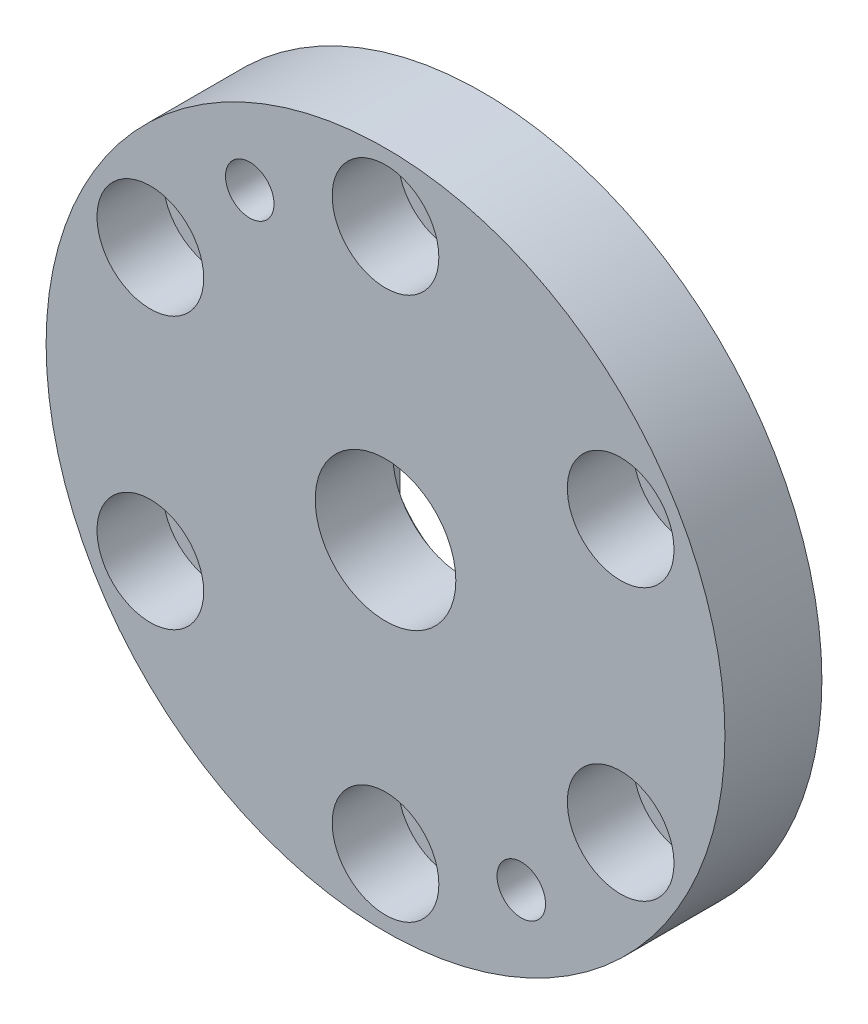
ISO-10303-21;
HEADER;
FILE_DESCRIPTION(('STEP AP214'),'2;1');
FILE_NAME('part.step','',(''),(''),'','','');
FILE_SCHEMA(('AUTOMOTIVE_DESIGN { 1 0 10303 214 1 1 1 1 }'));
ENDSEC;
DATA;
#1=APPLICATION_CONTEXT('core data for automotive mechanical design processes');
#2=APPLICATION_PROTOCOL_DEFINITION('international standard','automotive_design',2000,#1);
#3=PRODUCT_CONTEXT('',#1,'mechanical');
#4=PRODUCT('Part','Part','',(#3));
#5=PRODUCT_RELATED_PRODUCT_CATEGORY('part','',(#4));
#6=PRODUCT_DEFINITION_FORMATION('','',#4);
#7=PRODUCT_DEFINITION_CONTEXT('part definition',#1,'design');
#8=PRODUCT_DEFINITION('design','',#6,#7);
#9=PRODUCT_DEFINITION_SHAPE('','',#8);
#10=(LENGTH_UNIT() NAMED_UNIT(*) SI_UNIT(.MILLI.,.METRE.));
#11=(NAMED_UNIT(*) PLANE_ANGLE_UNIT() SI_UNIT($,.RADIAN.));
#12=(NAMED_UNIT(*) SI_UNIT($,.STERADIAN.) SOLID_ANGLE_UNIT());
#13=UNCERTAINTY_MEASURE_WITH_UNIT(LENGTH_MEASURE(1.E-05),#10,'distance_accuracy_value','');
#14=(GEOMETRIC_REPRESENTATION_CONTEXT(3) GLOBAL_UNCERTAINTY_ASSIGNED_CONTEXT((#13)) GLOBAL_UNIT_ASSIGNED_CONTEXT((#10,
#11,#12)) REPRESENTATION_CONTEXT('',''));
#15=CARTESIAN_POINT('',(0.,0.,0.));
#16=DIRECTION('',(0.,0.,1.));
#17=DIRECTION('',(1.,0.,0.));
#18=AXIS2_PLACEMENT_3D('',#15,#16,#17);
#19=CARTESIAN_POINT('',(0.,0.,0.));
#20=DIRECTION('',(0.,0.,1.));
#21=DIRECTION('',(1.,0.,0.));
#22=AXIS2_PLACEMENT_3D('',#19,#20,#21);
#23=CYLINDRICAL_SURFACE('',#22,7.25);
#24=CARTESIAN_POINT('',(0.,0.,0.));
#25=DIRECTION('',(0.,0.,1.));
#26=DIRECTION('',(1.,0.,0.));
#27=AXIS2_PLACEMENT_3D('',#24,#25,#26);
#28=CIRCLE('',#27,7.25);
#29=CARTESIAN_POINT('',(7.25,0.,0.));
#30=VERTEX_POINT('',#29);
#31=EDGE_CURVE('E181',#30,#30,#28,.T.);
#32=ORIENTED_EDGE('',*,*,#31,.T.);
#33=EDGE_LOOP('',(#32));
#34=FACE_BOUND('',#33,.T.);
#35=CARTESIAN_POINT('',(0.,0.,-8.));
#36=DIRECTION('',(0.,0.,-1.));
#37=DIRECTION('',(-1.,0.,0.));
#38=AXIS2_PLACEMENT_3D('',#35,#36,#37);
#39=CIRCLE('',#38,7.25);
#40=CARTESIAN_POINT('',(-7.25,0.,-8.));
#41=VERTEX_POINT('',#40);
#42=EDGE_CURVE('E20',#41,#41,#39,.F.);
#43=ORIENTED_EDGE('',*,*,#42,.F.);
#44=EDGE_LOOP('',(#43));
#45=FACE_BOUND('',#44,.T.);
#46=ADVANCED_FACE('F16',(#34,#45),#23,.F.);
#47=CARTESIAN_POINT('',(0.,0.,-10.));
#48=DIRECTION('',(0.,0.,1.));
#49=DIRECTION('',(1.,0.,0.));
#50=AXIS2_PLACEMENT_3D('',#47,#48,#49);
#51=CYLINDRICAL_SURFACE('',#50,35.);
#52=CARTESIAN_POINT('',(0.,0.,-10.));
#53=DIRECTION('',(0.,0.,1.));
#54=DIRECTION('',(1.,0.,0.));
#55=AXIS2_PLACEMENT_3D('',#52,#53,#54);
#56=CIRCLE('',#55,35.);
#57=CARTESIAN_POINT('',(35.,0.,-10.));
#58=VERTEX_POINT('',#57);
#59=EDGE_CURVE('E11',#58,#58,#56,.T.);
#60=ORIENTED_EDGE('',*,*,#59,.T.);
#61=EDGE_LOOP('',(#60));
#62=FACE_BOUND('',#61,.T.);
#63=CARTESIAN_POINT('',(0.,0.,0.));
#64=DIRECTION('',(0.,0.,1.));
#65=DIRECTION('',(1.,0.,0.));
#66=AXIS2_PLACEMENT_3D('',#63,#64,#65);
#67=CIRCLE('',#66,35.);
#68=CARTESIAN_POINT('',(35.,0.,0.));
#69=VERTEX_POINT('',#68);
#70=EDGE_CURVE('E25',#69,#69,#67,.T.);
#71=ORIENTED_EDGE('',*,*,#70,.F.);
#72=EDGE_LOOP('',(#71));
#73=FACE_BOUND('',#72,.T.);
#74=ADVANCED_FACE('F18',(#62,#73),#51,.T.);
#75=CARTESIAN_POINT('',(0.,0.,-10.));
#76=DIRECTION('',(0.,0.,1.));
#77=DIRECTION('',(1.,0.,0.));
#78=AXIS2_PLACEMENT_3D('',#75,#76,#77);
#79=PLANE('',#78);
#80=DIRECTION('',(0.,-1.,0.));
#81=VECTOR('',#80,1.);
#82=CARTESIAN_POINT('',(8.5,5.26782687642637,-10.));
#83=LINE('',#82,#81);
#84=CARTESIAN_POINT('',(8.5,5.26782687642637,-10.));
#85=VERTEX_POINT('',#84);
#86=CARTESIAN_POINT('',(8.5,-5.26782687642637,-10.));
#87=VERTEX_POINT('',#86);
#88=EDGE_CURVE('E68',#85,#87,#83,.T.);
#89=ORIENTED_EDGE('',*,*,#88,.F.);
#90=CARTESIAN_POINT('',(0.,0.,-10.));
#91=DIRECTION('',(0.,0.,-1.));
#92=DIRECTION('',(-1.,0.,0.));
#93=AXIS2_PLACEMENT_3D('',#90,#91,#92);
#94=CIRCLE('',#93,10.);
#95=CARTESIAN_POINT('',(-8.5,5.26782687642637,-10.));
#96=VERTEX_POINT('',#95);
#97=EDGE_CURVE('E33',#96,#85,#94,.T.);
#98=ORIENTED_EDGE('',*,*,#97,.F.);
#99=DIRECTION('',(0.,1.,0.));
#100=VECTOR('',#99,1.);
#101=CARTESIAN_POINT('',(-8.5,5.26782687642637,-10.));
#102=LINE('',#101,#100);
#103=CARTESIAN_POINT('',(-8.5,-5.26782687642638,-10.));
#104=VERTEX_POINT('',#103);
#105=EDGE_CURVE('E85',#104,#96,#102,.T.);
#106=ORIENTED_EDGE('',*,*,#105,.F.);
#107=CARTESIAN_POINT('',(0.,0.,-10.));
#108=DIRECTION('',(0.,0.,-1.));
#109=DIRECTION('',(-1.,0.,0.));
#110=AXIS2_PLACEMENT_3D('',#107,#108,#109);
#111=CIRCLE('',#110,10.);
#112=EDGE_CURVE('E91',#87,#104,#111,.T.);
#113=ORIENTED_EDGE('',*,*,#112,.F.);
#114=EDGE_LOOP('',(#89,#98,#106,#113));
#115=FACE_BOUND('',#114,.T.);
#116=CARTESIAN_POINT('',(-14.,24.2487113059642,-10.));
#117=DIRECTION('',(0.,0.,1.));
#118=DIRECTION('',(1.,0.,0.));
#119=AXIS2_PLACEMENT_3D('',#116,#117,#118);
#120=CIRCLE('',#119,2.5);
#121=CARTESIAN_POINT('',(-11.5,24.2487113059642,-10.));
#122=VERTEX_POINT('',#121);
#123=EDGE_CURVE('E100',#122,#122,#120,.T.);
#124=ORIENTED_EDGE('',*,*,#123,.T.);
#125=EDGE_LOOP('',(#124));
#126=FACE_BOUND('',#125,.T.);
#127=CARTESIAN_POINT('',(14.,-24.2487113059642,-10.));
#128=DIRECTION('',(0.,0.,1.));
#129=DIRECTION('',(1.,0.,0.));
#130=AXIS2_PLACEMENT_3D('',#127,#128,#129);
#131=CIRCLE('',#130,2.5);
#132=CARTESIAN_POINT('',(16.5,-24.2487113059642,-10.));
#133=VERTEX_POINT('',#132);
#134=EDGE_CURVE('E106',#133,#133,#131,.T.);
#135=ORIENTED_EDGE('',*,*,#134,.T.);
#136=EDGE_LOOP('',(#135));
#137=FACE_BOUND('',#136,.T.);
#138=CARTESIAN_POINT('',(0.,28.,-10.));
#139=DIRECTION('',(0.,0.,1.));
#140=DIRECTION('',(1.,0.,0.));
#141=AXIS2_PLACEMENT_3D('',#138,#139,#140);
#142=CIRCLE('',#141,3.3);
#143=CARTESIAN_POINT('',(3.3,28.,-10.));
#144=VERTEX_POINT('',#143);
#145=EDGE_CURVE('E118',#144,#144,#142,.T.);
#146=ORIENTED_EDGE('',*,*,#145,.T.);
#147=EDGE_LOOP('',(#146));
#148=FACE_BOUND('',#147,.T.);
#149=CARTESIAN_POINT('',(24.2487113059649,14.000000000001,-10.));
#150=DIRECTION('',(0.,0.,1.));
#151=DIRECTION('',(1.,0.,0.));
#152=AXIS2_PLACEMENT_3D('',#149,#150,#151);
#153=CIRCLE('',#152,3.3);
#154=CARTESIAN_POINT('',(27.5487113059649,14.000000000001,-10.));
#155=VERTEX_POINT('',#154);
#156=EDGE_CURVE('E130',#155,#155,#153,.T.);
#157=ORIENTED_EDGE('',*,*,#156,.T.);
#158=EDGE_LOOP('',(#157));
#159=FACE_BOUND('',#158,.T.);
#160=CARTESIAN_POINT('',(24.2487113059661,-13.999999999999,-10.));
#161=DIRECTION('',(0.,0.,1.));
#162=DIRECTION('',(1.,0.,0.));
#163=AXIS2_PLACEMENT_3D('',#160,#161,#162);
#164=CIRCLE('',#163,3.3);
#165=CARTESIAN_POINT('',(27.5487113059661,-13.999999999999,-10.));
#166=VERTEX_POINT('',#165);
#167=EDGE_CURVE('E142',#166,#166,#164,.T.);
#168=ORIENTED_EDGE('',*,*,#167,.T.);
#169=EDGE_LOOP('',(#168));
#170=FACE_BOUND('',#169,.T.);
#171=CARTESIAN_POINT('',(2.38056557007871E-12,-28.,-10.));
#172=DIRECTION('',(0.,0.,1.));
#173=DIRECTION('',(1.,0.,0.));
#174=AXIS2_PLACEMENT_3D('',#171,#172,#173);
#175=CIRCLE('',#174,3.3);
#176=CARTESIAN_POINT('',(3.30000000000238,-28.,-10.));
#177=VERTEX_POINT('',#176);
#178=EDGE_CURVE('E154',#177,#177,#175,.T.);
#179=ORIENTED_EDGE('',*,*,#178,.T.);
#180=EDGE_LOOP('',(#179));
#181=FACE_BOUND('',#180,.T.);
#182=CARTESIAN_POINT('',(-24.2487113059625,-14.000000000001,-10.));
#183=DIRECTION('',(0.,0.,1.));
#184=DIRECTION('',(1.,0.,0.));
#185=AXIS2_PLACEMENT_3D('',#182,#183,#184);
#186=CIRCLE('',#185,3.3);
#187=CARTESIAN_POINT('',(-20.9487113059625,-14.000000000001,-10.));
#188=VERTEX_POINT('',#187);
#189=EDGE_CURVE('E166',#188,#188,#186,.T.);
#190=ORIENTED_EDGE('',*,*,#189,.T.);
#191=EDGE_LOOP('',(#190));
#192=FACE_BOUND('',#191,.T.);
#193=CARTESIAN_POINT('',(-24.2487113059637,13.999999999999,-10.));
#194=DIRECTION('',(0.,0.,1.));
#195=DIRECTION('',(1.,0.,0.));
#196=AXIS2_PLACEMENT_3D('',#193,#194,#195);
#197=CIRCLE('',#196,3.3);
#198=CARTESIAN_POINT('',(-20.9487113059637,13.999999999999,-10.));
#199=VERTEX_POINT('',#198);
#200=EDGE_CURVE('E178',#199,#199,#197,.T.);
#201=ORIENTED_EDGE('',*,*,#200,.T.);
#202=EDGE_LOOP('',(#201));
#203=FACE_BOUND('',#202,.T.);
#204=ORIENTED_EDGE('',*,*,#59,.F.);
#205=EDGE_LOOP('',(#204));
#206=FACE_BOUND('',#205,.T.);
#207=ADVANCED_FACE('F189',(#115,#126,#137,#148,#159,#170,#181,#192,#203,#206),#79,.F.);
#208=CARTESIAN_POINT('',(0.,0.,0.));
#209=DIRECTION('',(0.,0.,1.));
#210=DIRECTION('',(1.,0.,0.));
#211=AXIS2_PLACEMENT_3D('',#208,#209,#210);
#212=PLANE('',#211);
#213=CARTESIAN_POINT('',(-14.,24.2487113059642,0.));
#214=DIRECTION('',(0.,0.,1.));
#215=DIRECTION('',(1.,0.,0.));
#216=AXIS2_PLACEMENT_3D('',#213,#214,#215);
#217=CIRCLE('',#216,2.5);
#218=CARTESIAN_POINT('',(-11.5,24.2487113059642,0.));
#219=VERTEX_POINT('',#218);
#220=EDGE_CURVE('E97',#219,#219,#217,.T.);
#221=ORIENTED_EDGE('',*,*,#220,.F.);
#222=EDGE_LOOP('',(#221));
#223=FACE_BOUND('',#222,.T.);
#224=CARTESIAN_POINT('',(14.,-24.2487113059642,0.));
#225=DIRECTION('',(0.,0.,1.));
#226=DIRECTION('',(1.,0.,0.));
#227=AXIS2_PLACEMENT_3D('',#224,#225,#226);
#228=CIRCLE('',#227,2.5);
#229=CARTESIAN_POINT('',(16.5,-24.2487113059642,0.));
#230=VERTEX_POINT('',#229);
#231=EDGE_CURVE('E103',#230,#230,#228,.T.);
#232=ORIENTED_EDGE('',*,*,#231,.F.);
#233=EDGE_LOOP('',(#232));
#234=FACE_BOUND('',#233,.T.);
#235=CARTESIAN_POINT('',(0.,28.,0.));
#236=DIRECTION('',(0.,0.,1.));
#237=DIRECTION('',(1.,0.,0.));
#238=AXIS2_PLACEMENT_3D('',#235,#236,#237);
#239=CIRCLE('',#238,5.5);
#240=CARTESIAN_POINT('',(5.5,28.,0.));
#241=VERTEX_POINT('',#240);
#242=EDGE_CURVE('E109',#241,#241,#239,.T.);
#243=ORIENTED_EDGE('',*,*,#242,.F.);
#244=EDGE_LOOP('',(#243));
#245=FACE_BOUND('',#244,.T.);
#246=CARTESIAN_POINT('',(24.2487113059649,14.000000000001,0.));
#247=DIRECTION('',(0.,0.,1.));
#248=DIRECTION('',(1.,0.,0.));
#249=AXIS2_PLACEMENT_3D('',#246,#247,#248);
#250=CIRCLE('',#249,5.5);
#251=CARTESIAN_POINT('',(29.7487113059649,14.000000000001,0.));
#252=VERTEX_POINT('',#251);
#253=EDGE_CURVE('E121',#252,#252,#250,.T.);
#254=ORIENTED_EDGE('',*,*,#253,.F.);
#255=EDGE_LOOP('',(#254));
#256=FACE_BOUND('',#255,.T.);
#257=CARTESIAN_POINT('',(24.2487113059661,-13.999999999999,0.));
#258=DIRECTION('',(0.,0.,1.));
#259=DIRECTION('',(1.,0.,0.));
#260=AXIS2_PLACEMENT_3D('',#257,#258,#259);
#261=CIRCLE('',#260,5.5);
#262=CARTESIAN_POINT('',(29.748711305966,-13.999999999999,0.));
#263=VERTEX_POINT('',#262);
#264=EDGE_CURVE('E133',#263,#263,#261,.T.);
#265=ORIENTED_EDGE('',*,*,#264,.F.);
#266=EDGE_LOOP('',(#265));
#267=FACE_BOUND('',#266,.T.);
#268=CARTESIAN_POINT('',(2.38056557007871E-12,-28.,0.));
#269=DIRECTION('',(0.,0.,1.));
#270=DIRECTION('',(1.,0.,0.));
#271=AXIS2_PLACEMENT_3D('',#268,#269,#270);
#272=CIRCLE('',#271,5.5);
#273=CARTESIAN_POINT('',(5.50000000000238,-28.,0.));
#274=VERTEX_POINT('',#273);
#275=EDGE_CURVE('E145',#274,#274,#272,.T.);
#276=ORIENTED_EDGE('',*,*,#275,.F.);
#277=EDGE_LOOP('',(#276));
#278=FACE_BOUND('',#277,.T.);
#279=CARTESIAN_POINT('',(-24.2487113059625,-14.000000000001,0.));
#280=DIRECTION('',(0.,0.,1.));
#281=DIRECTION('',(1.,0.,0.));
#282=AXIS2_PLACEMENT_3D('',#279,#280,#281);
#283=CIRCLE('',#282,5.5);
#284=CARTESIAN_POINT('',(-18.7487113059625,-14.000000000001,0.));
#285=VERTEX_POINT('',#284);
#286=EDGE_CURVE('E157',#285,#285,#283,.T.);
#287=ORIENTED_EDGE('',*,*,#286,.F.);
#288=EDGE_LOOP('',(#287));
#289=FACE_BOUND('',#288,.T.);
#290=CARTESIAN_POINT('',(-24.2487113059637,13.999999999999,0.));
#291=DIRECTION('',(0.,0.,1.));
#292=DIRECTION('',(1.,0.,0.));
#293=AXIS2_PLACEMENT_3D('',#290,#291,#292);
#294=CIRCLE('',#293,5.5);
#295=CARTESIAN_POINT('',(-18.7487113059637,13.999999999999,0.));
#296=VERTEX_POINT('',#295);
#297=EDGE_CURVE('E169',#296,#296,#294,.T.);
#298=ORIENTED_EDGE('',*,*,#297,.F.);
#299=EDGE_LOOP('',(#298));
#300=FACE_BOUND('',#299,.T.);
#301=ORIENTED_EDGE('',*,*,#31,.F.);
#302=EDGE_LOOP('',(#301));
#303=FACE_BOUND('',#302,.T.);
#304=ORIENTED_EDGE('',*,*,#70,.T.);
#305=EDGE_LOOP('',(#304));
#306=FACE_BOUND('',#305,.T.);
#307=ADVANCED_FACE('F186',(#223,#234,#245,#256,#267,#278,#289,#300,#303,#306),#212,.T.);
#308=CARTESIAN_POINT('',(-24.2487113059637,13.999999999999,0.));
#309=DIRECTION('',(0.,0.,1.));
#310=DIRECTION('',(1.,0.,0.));
#311=AXIS2_PLACEMENT_3D('',#308,#309,#310);
#312=CYLINDRICAL_SURFACE('',#311,3.3);
#313=ORIENTED_EDGE('',*,*,#200,.F.);
#314=EDGE_LOOP('',(#313));
#315=FACE_BOUND('',#314,.T.);
#316=CARTESIAN_POINT('',(-24.2487113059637,13.999999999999,-6.8));
#317=DIRECTION('',(0.,0.,1.));
#318=DIRECTION('',(1.,0.,0.));
#319=AXIS2_PLACEMENT_3D('',#316,#317,#318);
#320=CIRCLE('',#319,3.3);
#321=CARTESIAN_POINT('',(-20.9487113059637,13.999999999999,-6.8));
#322=VERTEX_POINT('',#321);
#323=EDGE_CURVE('E175',#322,#322,#320,.T.);
#324=ORIENTED_EDGE('',*,*,#323,.T.);
#325=EDGE_LOOP('',(#324));
#326=FACE_BOUND('',#325,.T.);
#327=ADVANCED_FACE('F208',(#315,#326),#312,.F.);
#328=CARTESIAN_POINT('',(-20.9487113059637,13.999999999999,-6.8));
#329=DIRECTION('',(0.,0.,-1.));
#330=DIRECTION('',(-1.,0.,0.));
#331=AXIS2_PLACEMENT_3D('',#328,#329,#330);
#332=PLANE('',#331);
#333=ORIENTED_EDGE('',*,*,#323,.F.);
#334=EDGE_LOOP('',(#333));
#335=FACE_BOUND('',#334,.T.);
#336=CARTESIAN_POINT('',(-24.2487113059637,13.999999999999,-6.8));
#337=DIRECTION('',(0.,0.,1.));
#338=DIRECTION('',(1.,0.,0.));
#339=AXIS2_PLACEMENT_3D('',#336,#337,#338);
#340=CIRCLE('',#339,5.5);
#341=CARTESIAN_POINT('',(-18.7487113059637,13.999999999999,-6.8));
#342=VERTEX_POINT('',#341);
#343=EDGE_CURVE('E172',#342,#342,#340,.T.);
#344=ORIENTED_EDGE('',*,*,#343,.T.);
#345=EDGE_LOOP('',(#344));
#346=FACE_BOUND('',#345,.T.);
#347=ADVANCED_FACE('F216',(#335,#346),#332,.F.);
#348=CARTESIAN_POINT('',(-24.2487113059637,13.999999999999,0.));
#349=DIRECTION('',(0.,0.,1.));
#350=DIRECTION('',(1.,0.,0.));
#351=AXIS2_PLACEMENT_3D('',#348,#349,#350);
#352=CYLINDRICAL_SURFACE('',#351,5.5);
#353=ORIENTED_EDGE('',*,*,#343,.F.);
#354=EDGE_LOOP('',(#353));
#355=FACE_BOUND('',#354,.T.);
#356=ORIENTED_EDGE('',*,*,#297,.T.);
#357=EDGE_LOOP('',(#356));
#358=FACE_BOUND('',#357,.T.);
#359=ADVANCED_FACE('F236',(#355,#358),#352,.F.);
#360=CARTESIAN_POINT('',(-24.2487113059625,-14.000000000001,0.));
#361=DIRECTION('',(0.,0.,1.));
#362=DIRECTION('',(1.,0.,0.));
#363=AXIS2_PLACEMENT_3D('',#360,#361,#362);
#364=CYLINDRICAL_SURFACE('',#363,3.3);
#365=ORIENTED_EDGE('',*,*,#189,.F.);
#366=EDGE_LOOP('',(#365));
#367=FACE_BOUND('',#366,.T.);
#368=CARTESIAN_POINT('',(-24.2487113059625,-14.000000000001,-6.8));
#369=DIRECTION('',(0.,0.,1.));
#370=DIRECTION('',(1.,0.,0.));
#371=AXIS2_PLACEMENT_3D('',#368,#369,#370);
#372=CIRCLE('',#371,3.3);
#373=CARTESIAN_POINT('',(-20.9487113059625,-14.000000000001,-6.8));
#374=VERTEX_POINT('',#373);
#375=EDGE_CURVE('E163',#374,#374,#372,.T.);
#376=ORIENTED_EDGE('',*,*,#375,.T.);
#377=EDGE_LOOP('',(#376));
#378=FACE_BOUND('',#377,.T.);
#379=ADVANCED_FACE('F238',(#367,#378),#364,.F.);
#380=CARTESIAN_POINT('',(-20.9487113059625,-14.000000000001,-6.8));
#381=DIRECTION('',(0.,0.,-1.));
#382=DIRECTION('',(-1.,0.,0.));
#383=AXIS2_PLACEMENT_3D('',#380,#381,#382);
#384=PLANE('',#383);
#385=ORIENTED_EDGE('',*,*,#375,.F.);
#386=EDGE_LOOP('',(#385));
#387=FACE_BOUND('',#386,.T.);
#388=CARTESIAN_POINT('',(-24.2487113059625,-14.000000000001,-6.8));
#389=DIRECTION('',(0.,0.,1.));
#390=DIRECTION('',(1.,0.,0.));
#391=AXIS2_PLACEMENT_3D('',#388,#389,#390);
#392=CIRCLE('',#391,5.5);
#393=CARTESIAN_POINT('',(-18.7487113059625,-14.000000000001,-6.8));
#394=VERTEX_POINT('',#393);
#395=EDGE_CURVE('E160',#394,#394,#392,.T.);
#396=ORIENTED_EDGE('',*,*,#395,.T.);
#397=EDGE_LOOP('',(#396));
#398=FACE_BOUND('',#397,.T.);
#399=ADVANCED_FACE('F246',(#387,#398),#384,.F.);
#400=CARTESIAN_POINT('',(-24.2487113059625,-14.000000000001,0.));
#401=DIRECTION('',(0.,0.,1.));
#402=DIRECTION('',(1.,0.,0.));
#403=AXIS2_PLACEMENT_3D('',#400,#401,#402);
#404=CYLINDRICAL_SURFACE('',#403,5.5);
#405=ORIENTED_EDGE('',*,*,#395,.F.);
#406=EDGE_LOOP('',(#405));
#407=FACE_BOUND('',#406,.T.);
#408=ORIENTED_EDGE('',*,*,#286,.T.);
#409=EDGE_LOOP('',(#408));
#410=FACE_BOUND('',#409,.T.);
#411=ADVANCED_FACE('F254',(#407,#410),#404,.F.);
#412=CARTESIAN_POINT('',(2.38056557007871E-12,-28.,0.));
#413=DIRECTION('',(0.,0.,1.));
#414=DIRECTION('',(1.,0.,0.));
#415=AXIS2_PLACEMENT_3D('',#412,#413,#414);
#416=CYLINDRICAL_SURFACE('',#415,3.3);
#417=ORIENTED_EDGE('',*,*,#178,.F.);
#418=EDGE_LOOP('',(#417));
#419=FACE_BOUND('',#418,.T.);
#420=CARTESIAN_POINT('',(2.38056557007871E-12,-28.,-6.8));
#421=DIRECTION('',(0.,0.,1.));
#422=DIRECTION('',(1.,0.,0.));
#423=AXIS2_PLACEMENT_3D('',#420,#421,#422);
#424=CIRCLE('',#423,3.3);
#425=CARTESIAN_POINT('',(3.30000000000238,-28.,-6.8));
#426=VERTEX_POINT('',#425);
#427=EDGE_CURVE('E151',#426,#426,#424,.T.);
#428=ORIENTED_EDGE('',*,*,#427,.T.);
#429=EDGE_LOOP('',(#428));
#430=FACE_BOUND('',#429,.T.);
#431=ADVANCED_FACE('F258',(#419,#430),#416,.F.);
#432=CARTESIAN_POINT('',(3.30000000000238,-28.,-6.8));
#433=DIRECTION('',(0.,0.,-1.));
#434=DIRECTION('',(-1.,0.,0.));
#435=AXIS2_PLACEMENT_3D('',#432,#433,#434);
#436=PLANE('',#435);
#437=ORIENTED_EDGE('',*,*,#427,.F.);
#438=EDGE_LOOP('',(#437));
#439=FACE_BOUND('',#438,.T.);
#440=CARTESIAN_POINT('',(2.38056557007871E-12,-28.,-6.8));
#441=DIRECTION('',(0.,0.,1.));
#442=DIRECTION('',(1.,0.,0.));
#443=AXIS2_PLACEMENT_3D('',#440,#441,#442);
#444=CIRCLE('',#443,5.5);
#445=CARTESIAN_POINT('',(5.50000000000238,-28.,-6.8));
#446=VERTEX_POINT('',#445);
#447=EDGE_CURVE('E148',#446,#446,#444,.T.);
#448=ORIENTED_EDGE('',*,*,#447,.T.);
#449=EDGE_LOOP('',(#448));
#450=FACE_BOUND('',#449,.T.);
#451=ADVANCED_FACE('F262',(#439,#450),#436,.F.);
#452=CARTESIAN_POINT('',(2.38056557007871E-12,-28.,0.));
#453=DIRECTION('',(0.,0.,1.));
#454=DIRECTION('',(1.,0.,0.));
#455=AXIS2_PLACEMENT_3D('',#452,#453,#454);
#456=CYLINDRICAL_SURFACE('',#455,5.5);
#457=ORIENTED_EDGE('',*,*,#447,.F.);
#458=EDGE_LOOP('',(#457));
#459=FACE_BOUND('',#458,.T.);
#460=ORIENTED_EDGE('',*,*,#275,.T.);
#461=EDGE_LOOP('',(#460));
#462=FACE_BOUND('',#461,.T.);
#463=ADVANCED_FACE('F266',(#459,#462),#456,.F.);
#464=CARTESIAN_POINT('',(24.2487113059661,-13.999999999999,0.));
#465=DIRECTION('',(0.,0.,1.));
#466=DIRECTION('',(1.,0.,0.));
#467=AXIS2_PLACEMENT_3D('',#464,#465,#466);
#468=CYLINDRICAL_SURFACE('',#467,3.3);
#469=ORIENTED_EDGE('',*,*,#167,.F.);
#470=EDGE_LOOP('',(#469));
#471=FACE_BOUND('',#470,.T.);
#472=CARTESIAN_POINT('',(24.2487113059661,-13.999999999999,-6.8));
#473=DIRECTION('',(0.,0.,1.));
#474=DIRECTION('',(1.,0.,0.));
#475=AXIS2_PLACEMENT_3D('',#472,#473,#474);
#476=CIRCLE('',#475,3.3);
#477=CARTESIAN_POINT('',(27.5487113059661,-13.999999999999,-6.8));
#478=VERTEX_POINT('',#477);
#479=EDGE_CURVE('E139',#478,#478,#476,.T.);
#480=ORIENTED_EDGE('',*,*,#479,.T.);
#481=EDGE_LOOP('',(#480));
#482=FACE_BOUND('',#481,.T.);
#483=ADVANCED_FACE('F270',(#471,#482),#468,.F.);
#484=CARTESIAN_POINT('',(27.5487113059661,-13.999999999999,-6.8));
#485=DIRECTION('',(0.,0.,-1.));
#486=DIRECTION('',(-1.,0.,0.));
#487=AXIS2_PLACEMENT_3D('',#484,#485,#486);
#488=PLANE('',#487);
#489=ORIENTED_EDGE('',*,*,#479,.F.);
#490=EDGE_LOOP('',(#489));
#491=FACE_BOUND('',#490,.T.);
#492=CARTESIAN_POINT('',(24.2487113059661,-13.999999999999,-6.8));
#493=DIRECTION('',(0.,0.,1.));
#494=DIRECTION('',(1.,0.,0.));
#495=AXIS2_PLACEMENT_3D('',#492,#493,#494);
#496=CIRCLE('',#495,5.5);
#497=CARTESIAN_POINT('',(29.748711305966,-13.999999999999,-6.8));
#498=VERTEX_POINT('',#497);
#499=EDGE_CURVE('E136',#498,#498,#496,.T.);
#500=ORIENTED_EDGE('',*,*,#499,.T.);
#501=EDGE_LOOP('',(#500));
#502=FACE_BOUND('',#501,.T.);
#503=ADVANCED_FACE('F274',(#491,#502),#488,.F.);
#504=CARTESIAN_POINT('',(24.2487113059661,-13.999999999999,0.));
#505=DIRECTION('',(0.,0.,1.));
#506=DIRECTION('',(1.,0.,0.));
#507=AXIS2_PLACEMENT_3D('',#504,#505,#506);
#508=CYLINDRICAL_SURFACE('',#507,5.5);
#509=ORIENTED_EDGE('',*,*,#499,.F.);
#510=EDGE_LOOP('',(#509));
#511=FACE_BOUND('',#510,.T.);
#512=ORIENTED_EDGE('',*,*,#264,.T.);
#513=EDGE_LOOP('',(#512));
#514=FACE_BOUND('',#513,.T.);
#515=ADVANCED_FACE('F278',(#511,#514),#508,.F.);
#516=CARTESIAN_POINT('',(24.2487113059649,14.000000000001,0.));
#517=DIRECTION('',(0.,0.,1.));
#518=DIRECTION('',(1.,0.,0.));
#519=AXIS2_PLACEMENT_3D('',#516,#517,#518);
#520=CYLINDRICAL_SURFACE('',#519,3.3);
#521=ORIENTED_EDGE('',*,*,#156,.F.);
#522=EDGE_LOOP('',(#521));
#523=FACE_BOUND('',#522,.T.);
#524=CARTESIAN_POINT('',(24.2487113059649,14.000000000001,-6.8));
#525=DIRECTION('',(0.,0.,1.));
#526=DIRECTION('',(1.,0.,0.));
#527=AXIS2_PLACEMENT_3D('',#524,#525,#526);
#528=CIRCLE('',#527,3.3);
#529=CARTESIAN_POINT('',(27.5487113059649,14.000000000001,-6.8));
#530=VERTEX_POINT('',#529);
#531=EDGE_CURVE('E127',#530,#530,#528,.T.);
#532=ORIENTED_EDGE('',*,*,#531,.T.);
#533=EDGE_LOOP('',(#532));
#534=FACE_BOUND('',#533,.T.);
#535=ADVANCED_FACE('F282',(#523,#534),#520,.F.);
#536=CARTESIAN_POINT('',(27.5487113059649,14.000000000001,-6.8));
#537=DIRECTION('',(0.,0.,-1.));
#538=DIRECTION('',(-1.,0.,0.));
#539=AXIS2_PLACEMENT_3D('',#536,#537,#538);
#540=PLANE('',#539);
#541=ORIENTED_EDGE('',*,*,#531,.F.);
#542=EDGE_LOOP('',(#541));
#543=FACE_BOUND('',#542,.T.);
#544=CARTESIAN_POINT('',(24.2487113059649,14.000000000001,-6.8));
#545=DIRECTION('',(0.,0.,1.));
#546=DIRECTION('',(1.,0.,0.));
#547=AXIS2_PLACEMENT_3D('',#544,#545,#546);
#548=CIRCLE('',#547,5.5);
#549=CARTESIAN_POINT('',(29.7487113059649,14.000000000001,-6.8));
#550=VERTEX_POINT('',#549);
#551=EDGE_CURVE('E124',#550,#550,#548,.T.);
#552=ORIENTED_EDGE('',*,*,#551,.T.);
#553=EDGE_LOOP('',(#552));
#554=FACE_BOUND('',#553,.T.);
#555=ADVANCED_FACE('F286',(#543,#554),#540,.F.);
#556=CARTESIAN_POINT('',(24.2487113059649,14.000000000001,0.));
#557=DIRECTION('',(0.,0.,1.));
#558=DIRECTION('',(1.,0.,0.));
#559=AXIS2_PLACEMENT_3D('',#556,#557,#558);
#560=CYLINDRICAL_SURFACE('',#559,5.5);
#561=ORIENTED_EDGE('',*,*,#551,.F.);
#562=EDGE_LOOP('',(#561));
#563=FACE_BOUND('',#562,.T.);
#564=ORIENTED_EDGE('',*,*,#253,.T.);
#565=EDGE_LOOP('',(#564));
#566=FACE_BOUND('',#565,.T.);
#567=ADVANCED_FACE('F290',(#563,#566),#560,.F.);
#568=CARTESIAN_POINT('',(0.,28.,0.));
#569=DIRECTION('',(0.,0.,1.));
#570=DIRECTION('',(1.,0.,0.));
#571=AXIS2_PLACEMENT_3D('',#568,#569,#570);
#572=CYLINDRICAL_SURFACE('',#571,3.3);
#573=ORIENTED_EDGE('',*,*,#145,.F.);
#574=EDGE_LOOP('',(#573));
#575=FACE_BOUND('',#574,.T.);
#576=CARTESIAN_POINT('',(0.,28.,-6.8));
#577=DIRECTION('',(0.,0.,1.));
#578=DIRECTION('',(1.,0.,0.));
#579=AXIS2_PLACEMENT_3D('',#576,#577,#578);
#580=CIRCLE('',#579,3.3);
#581=CARTESIAN_POINT('',(3.3,28.,-6.8));
#582=VERTEX_POINT('',#581);
#583=EDGE_CURVE('E115',#582,#582,#580,.T.);
#584=ORIENTED_EDGE('',*,*,#583,.T.);
#585=EDGE_LOOP('',(#584));
#586=FACE_BOUND('',#585,.T.);
#587=ADVANCED_FACE('F294',(#575,#586),#572,.F.);
#588=CARTESIAN_POINT('',(3.3,28.,-6.8));
#589=DIRECTION('',(0.,0.,-1.));
#590=DIRECTION('',(-1.,0.,0.));
#591=AXIS2_PLACEMENT_3D('',#588,#589,#590);
#592=PLANE('',#591);
#593=ORIENTED_EDGE('',*,*,#583,.F.);
#594=EDGE_LOOP('',(#593));
#595=FACE_BOUND('',#594,.T.);
#596=CARTESIAN_POINT('',(0.,28.,-6.8));
#597=DIRECTION('',(0.,0.,1.));
#598=DIRECTION('',(1.,0.,0.));
#599=AXIS2_PLACEMENT_3D('',#596,#597,#598);
#600=CIRCLE('',#599,5.5);
#601=CARTESIAN_POINT('',(5.5,28.,-6.8));
#602=VERTEX_POINT('',#601);
#603=EDGE_CURVE('E112',#602,#602,#600,.T.);
#604=ORIENTED_EDGE('',*,*,#603,.T.);
#605=EDGE_LOOP('',(#604));
#606=FACE_BOUND('',#605,.T.);
#607=ADVANCED_FACE('F298',(#595,#606),#592,.F.);
#608=CARTESIAN_POINT('',(0.,28.,0.));
#609=DIRECTION('',(0.,0.,1.));
#610=DIRECTION('',(1.,0.,0.));
#611=AXIS2_PLACEMENT_3D('',#608,#609,#610);
#612=CYLINDRICAL_SURFACE('',#611,5.5);
#613=ORIENTED_EDGE('',*,*,#603,.F.);
#614=EDGE_LOOP('',(#613));
#615=FACE_BOUND('',#614,.T.);
#616=ORIENTED_EDGE('',*,*,#242,.T.);
#617=EDGE_LOOP('',(#616));
#618=FACE_BOUND('',#617,.T.);
#619=ADVANCED_FACE('F302',(#615,#618),#612,.F.);
#620=CARTESIAN_POINT('',(14.,-24.2487113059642,0.));
#621=DIRECTION('',(0.,0.,1.));
#622=DIRECTION('',(1.,0.,0.));
#623=AXIS2_PLACEMENT_3D('',#620,#621,#622);
#624=CYLINDRICAL_SURFACE('',#623,2.5);
#625=ORIENTED_EDGE('',*,*,#134,.F.);
#626=EDGE_LOOP('',(#625));
#627=FACE_BOUND('',#626,.T.);
#628=ORIENTED_EDGE('',*,*,#231,.T.);
#629=EDGE_LOOP('',(#628));
#630=FACE_BOUND('',#629,.T.);
#631=ADVANCED_FACE('F306',(#627,#630),#624,.F.);
#632=CARTESIAN_POINT('',(-14.,24.2487113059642,0.));
#633=DIRECTION('',(0.,0.,1.));
#634=DIRECTION('',(1.,0.,0.));
#635=AXIS2_PLACEMENT_3D('',#632,#633,#634);
#636=CYLINDRICAL_SURFACE('',#635,2.5);
#637=ORIENTED_EDGE('',*,*,#123,.F.);
#638=EDGE_LOOP('',(#637));
#639=FACE_BOUND('',#638,.T.);
#640=ORIENTED_EDGE('',*,*,#220,.T.);
#641=EDGE_LOOP('',(#640));
#642=FACE_BOUND('',#641,.T.);
#643=ADVANCED_FACE('F310',(#639,#642),#636,.F.);
#644=CARTESIAN_POINT('',(0.,0.,-8.));
#645=DIRECTION('',(0.,0.,-1.));
#646=DIRECTION('',(-1.,0.,0.));
#647=AXIS2_PLACEMENT_3D('',#644,#645,#646);
#648=PLANE('',#647);
#649=CARTESIAN_POINT('',(0.,0.,-8.));
#650=DIRECTION('',(0.,0.,-1.));
#651=DIRECTION('',(-1.,0.,0.));
#652=AXIS2_PLACEMENT_3D('',#649,#650,#651);
#653=CIRCLE('',#652,10.);
#654=CARTESIAN_POINT('',(-8.5,5.26782687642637,-8.));
#655=VERTEX_POINT('',#654);
#656=CARTESIAN_POINT('',(8.5,5.26782687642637,-8.));
#657=VERTEX_POINT('',#656);
#658=EDGE_CURVE('E83',#655,#657,#653,.T.);
#659=ORIENTED_EDGE('',*,*,#658,.T.);
#660=DIRECTION('',(0.,-1.,0.));
#661=VECTOR('',#660,1.);
#662=CARTESIAN_POINT('',(8.5,5.26782687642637,-8.));
#663=LINE('',#662,#661);
#664=CARTESIAN_POINT('',(8.5,-5.26782687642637,-8.));
#665=VERTEX_POINT('',#664);
#666=EDGE_CURVE('E65',#657,#665,#663,.T.);
#667=ORIENTED_EDGE('',*,*,#666,.T.);
#668=CARTESIAN_POINT('',(0.,0.,-8.));
#669=DIRECTION('',(0.,0.,-1.));
#670=DIRECTION('',(-1.,0.,0.));
#671=AXIS2_PLACEMENT_3D('',#668,#669,#670);
#672=CIRCLE('',#671,10.);
#673=CARTESIAN_POINT('',(-8.5,-5.26782687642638,-8.));
#674=VERTEX_POINT('',#673);
#675=EDGE_CURVE('E75',#665,#674,#672,.T.);
#676=ORIENTED_EDGE('',*,*,#675,.T.);
#677=DIRECTION('',(0.,1.,0.));
#678=VECTOR('',#677,1.);
#679=CARTESIAN_POINT('',(-8.5,5.26782687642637,-8.));
#680=LINE('',#679,#678);
#681=EDGE_CURVE('E79',#674,#655,#680,.T.);
#682=ORIENTED_EDGE('',*,*,#681,.T.);
#683=EDGE_LOOP('',(#659,#667,#676,#682));
#684=FACE_BOUND('',#683,.T.);
#685=ORIENTED_EDGE('',*,*,#42,.T.);
#686=EDGE_LOOP('',(#685));
#687=FACE_BOUND('',#686,.T.);
#688=ADVANCED_FACE('F81',(#684,#687),#648,.T.);
#689=CARTESIAN_POINT('',(0.,0.,-8.));
#690=DIRECTION('',(0.,0.,-1.));
#691=DIRECTION('',(-1.,0.,0.));
#692=AXIS2_PLACEMENT_3D('',#689,#690,#691);
#693=CYLINDRICAL_SURFACE('',#692,10.);
#694=ORIENTED_EDGE('',*,*,#97,.T.);
#695=DIRECTION('',(0.,0.,-1.));
#696=VECTOR('',#695,1.);
#697=CARTESIAN_POINT('',(8.5,5.26782687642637,-8.));
#698=LINE('',#697,#696);
#699=EDGE_CURVE('E56',#657,#85,#698,.T.);
#700=ORIENTED_EDGE('',*,*,#699,.F.);
#701=ORIENTED_EDGE('',*,*,#658,.F.);
#702=DIRECTION('',(0.,0.,-1.));
#703=VECTOR('',#702,1.);
#704=CARTESIAN_POINT('',(-8.5,5.26782687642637,-8.));
#705=LINE('',#704,#703);
#706=EDGE_CURVE('E41',#655,#96,#705,.T.);
#707=ORIENTED_EDGE('',*,*,#706,.T.);
#708=EDGE_LOOP('',(#694,#700,#701,#707));
#709=FACE_BOUND('',#708,.T.);
#710=ADVANCED_FACE('F315',(#709),#693,.F.);
#711=CARTESIAN_POINT('',(-8.5,5.26782687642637,-8.));
#712=DIRECTION('',(-1.,0.,0.));
#713=DIRECTION('',(0.,0.,1.));
#714=AXIS2_PLACEMENT_3D('',#711,#712,#713);
#715=PLANE('',#714);
#716=ORIENTED_EDGE('',*,*,#105,.T.);
#717=ORIENTED_EDGE('',*,*,#706,.F.);
#718=ORIENTED_EDGE('',*,*,#681,.F.);
#719=DIRECTION('',(0.,0.,-1.));
#720=VECTOR('',#719,1.);
#721=CARTESIAN_POINT('',(-8.5,-5.26782687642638,-8.));
#722=LINE('',#721,#720);
#723=EDGE_CURVE('E72',#674,#104,#722,.T.);
#724=ORIENTED_EDGE('',*,*,#723,.T.);
#725=EDGE_LOOP('',(#716,#717,#718,#724));
#726=FACE_BOUND('',#725,.T.);
#727=ADVANCED_FACE('F318',(#726),#715,.F.);
#728=CARTESIAN_POINT('',(0.,0.,-8.));
#729=DIRECTION('',(0.,0.,-1.));
#730=DIRECTION('',(-1.,0.,0.));
#731=AXIS2_PLACEMENT_3D('',#728,#729,#730);
#732=CYLINDRICAL_SURFACE('',#731,10.);
#733=ORIENTED_EDGE('',*,*,#112,.T.);
#734=ORIENTED_EDGE('',*,*,#723,.F.);
#735=ORIENTED_EDGE('',*,*,#675,.F.);
#736=DIRECTION('',(0.,0.,-1.));
#737=VECTOR('',#736,1.);
#738=CARTESIAN_POINT('',(8.5,-5.26782687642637,-8.));
#739=LINE('',#738,#737);
#740=EDGE_CURVE('E61',#665,#87,#739,.T.);
#741=ORIENTED_EDGE('',*,*,#740,.T.);
#742=EDGE_LOOP('',(#733,#734,#735,#741));
#743=FACE_BOUND('',#742,.T.);
#744=ADVANCED_FACE('F76',(#743),#732,.F.);
#745=CARTESIAN_POINT('',(8.5,5.26782687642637,-8.));
#746=DIRECTION('',(1.,0.,0.));
#747=DIRECTION('',(0.,0.,-1.));
#748=AXIS2_PLACEMENT_3D('',#745,#746,#747);
#749=PLANE('',#748);
#750=ORIENTED_EDGE('',*,*,#88,.T.);
#751=ORIENTED_EDGE('',*,*,#740,.F.);
#752=ORIENTED_EDGE('',*,*,#666,.F.);
#753=ORIENTED_EDGE('',*,*,#699,.T.);
#754=EDGE_LOOP('',(#750,#751,#752,#753));
#755=FACE_BOUND('',#754,.T.);
#756=ADVANCED_FACE('F63',(#755),#749,.F.);
#757=CLOSED_SHELL('',(#46,#74,#207,#307,#327,#347,#359,#379,#399,#411,#431,#451,#463,#483,#503,
#515,#535,#555,#567,#587,#607,#619,#631,#643,#688,#710,#727,#744,#756));
#758=MANIFOLD_SOLID_BREP('B1',#757);
#759=ADVANCED_BREP_SHAPE_REPRESENTATION('',(#18,#758),#14);
#760=SHAPE_DEFINITION_REPRESENTATION(#9,#759);
ENDSEC;
END-ISO-10303-21;
